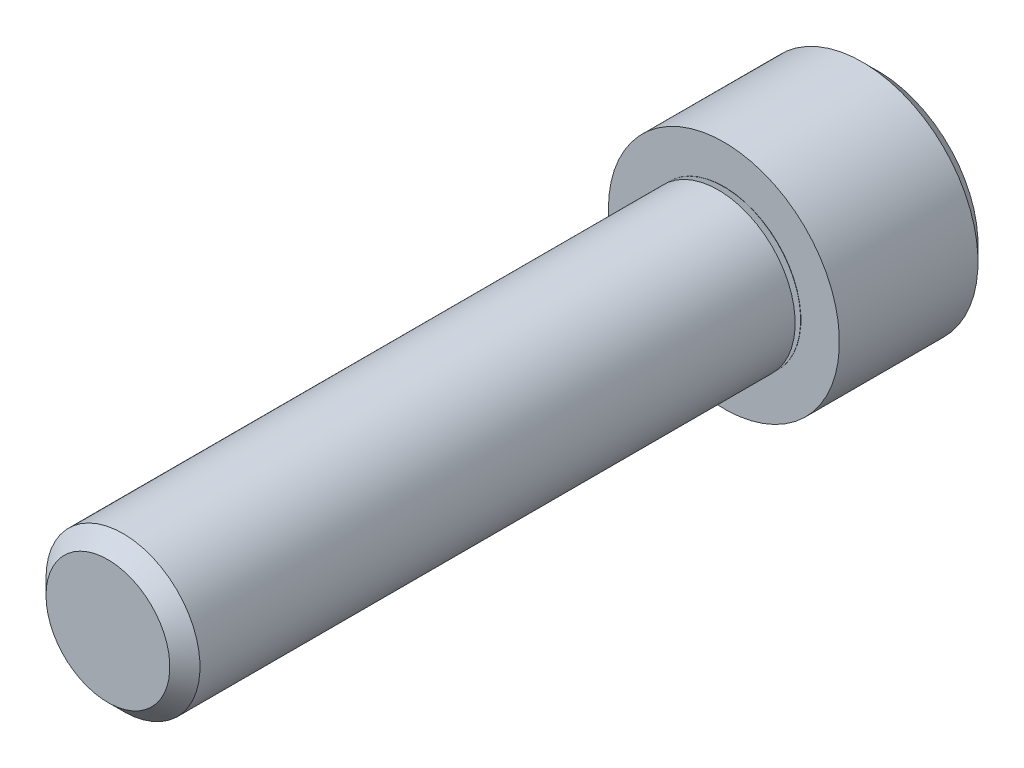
ISO-10303-21;
HEADER;
FILE_DESCRIPTION(('STEP AP214'),'2;1');
FILE_NAME('part.step','',(''),(''),'','','');
FILE_SCHEMA(('AUTOMOTIVE_DESIGN { 1 0 10303 214 1 1 1 1 }'));
ENDSEC;
DATA;
#1=APPLICATION_CONTEXT('core data for automotive mechanical design processes');
#2=APPLICATION_PROTOCOL_DEFINITION('international standard','automotive_design',2000,#1);
#3=PRODUCT_CONTEXT('',#1,'mechanical');
#4=PRODUCT('Part','Part','',(#3));
#5=PRODUCT_RELATED_PRODUCT_CATEGORY('part','',(#4));
#6=PRODUCT_DEFINITION_FORMATION('','',#4);
#7=PRODUCT_DEFINITION_CONTEXT('part definition',#1,'design');
#8=PRODUCT_DEFINITION('design','',#6,#7);
#9=PRODUCT_DEFINITION_SHAPE('','',#8);
#10=(LENGTH_UNIT() NAMED_UNIT(*) SI_UNIT(.MILLI.,.METRE.));
#11=(NAMED_UNIT(*) PLANE_ANGLE_UNIT() SI_UNIT($,.RADIAN.));
#12=(NAMED_UNIT(*) SI_UNIT($,.STERADIAN.) SOLID_ANGLE_UNIT());
#13=UNCERTAINTY_MEASURE_WITH_UNIT(LENGTH_MEASURE(1.E-05),#10,'distance_accuracy_value','');
#14=(GEOMETRIC_REPRESENTATION_CONTEXT(3) GLOBAL_UNCERTAINTY_ASSIGNED_CONTEXT((#13)) GLOBAL_UNIT_ASSIGNED_CONTEXT((#10,
#11,#12)) REPRESENTATION_CONTEXT('',''));
#15=CARTESIAN_POINT('',(0.,0.,0.));
#16=DIRECTION('',(0.,0.,1.));
#17=DIRECTION('',(1.,0.,0.));
#18=AXIS2_PLACEMENT_3D('',#15,#16,#17);
#19=CARTESIAN_POINT('',(0.,0.,-6.35));
#20=DIRECTION('',(0.,0.,1.));
#21=DIRECTION('',(1.,0.,0.));
#22=AXIS2_PLACEMENT_3D('',#19,#20,#21);
#23=PLANE('',#22);
#24=DIRECTION('',(-0.5,-0.866025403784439,0.));
#25=VECTOR('',#24,1.);
#26=CARTESIAN_POINT('',(2.74963065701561,0.,-6.35));
#27=LINE('',#26,#25);
#28=CARTESIAN_POINT('',(2.74963065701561,0.,-6.35));
#29=VERTEX_POINT('',#28);
#30=CARTESIAN_POINT('',(1.37481532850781,-2.38125,-6.35));
#31=VERTEX_POINT('',#30);
#32=EDGE_CURVE('E164',#29,#31,#27,.T.);
#33=ORIENTED_EDGE('',*,*,#32,.F.);
#34=DIRECTION('',(0.499999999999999,-0.866025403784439,0.));
#35=VECTOR('',#34,1.);
#36=CARTESIAN_POINT('',(1.37481532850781,2.38125,-6.35));
#37=LINE('',#36,#35);
#38=CARTESIAN_POINT('',(1.37481532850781,2.38125,-6.35));
#39=VERTEX_POINT('',#38);
#40=EDGE_CURVE('E73',#39,#29,#37,.T.);
#41=ORIENTED_EDGE('',*,*,#40,.F.);
#42=DIRECTION('',(1.,0.,0.));
#43=VECTOR('',#42,1.);
#44=CARTESIAN_POINT('',(-1.37481532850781,2.38125,-6.35));
#45=LINE('',#44,#43);
#46=CARTESIAN_POINT('',(-1.37481532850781,2.38125,-6.35));
#47=VERTEX_POINT('',#46);
#48=EDGE_CURVE('E177',#47,#39,#45,.T.);
#49=ORIENTED_EDGE('',*,*,#48,.F.);
#50=DIRECTION('',(0.5,0.866025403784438,0.));
#51=VECTOR('',#50,1.);
#52=CARTESIAN_POINT('',(-2.74963065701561,0.,-6.35));
#53=LINE('',#52,#51);
#54=CARTESIAN_POINT('',(-2.74963065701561,0.,-6.35));
#55=VERTEX_POINT('',#54);
#56=EDGE_CURVE('E174',#55,#47,#53,.T.);
#57=ORIENTED_EDGE('',*,*,#56,.F.);
#58=DIRECTION('',(-0.5,0.866025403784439,0.));
#59=VECTOR('',#58,1.);
#60=CARTESIAN_POINT('',(-1.37481532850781,-2.38125,-6.35));
#61=LINE('',#60,#59);
#62=CARTESIAN_POINT('',(-1.37481532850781,-2.38125,-6.35));
#63=VERTEX_POINT('',#62);
#64=EDGE_CURVE('E130',#63,#55,#61,.T.);
#65=ORIENTED_EDGE('',*,*,#64,.F.);
#66=DIRECTION('',(-1.,0.,0.));
#67=VECTOR('',#66,1.);
#68=CARTESIAN_POINT('',(1.37481532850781,-2.38125,-6.35));
#69=LINE('',#68,#67);
#70=EDGE_CURVE('E168',#31,#63,#69,.T.);
#71=ORIENTED_EDGE('',*,*,#70,.F.);
#72=EDGE_LOOP('',(#33,#41,#49,#57,#65,#71));
#73=FACE_BOUND('',#72,.T.);
#74=CARTESIAN_POINT('',(0.,0.,-6.35));
#75=DIRECTION('',(0.,0.,-1.));
#76=DIRECTION('',(-1.,0.,0.));
#77=AXIS2_PLACEMENT_3D('',#74,#75,#76);
#78=CIRCLE('',#77,4.1275);
#79=CARTESIAN_POINT('',(-4.1275,0.,-6.35));
#80=VERTEX_POINT('',#79);
#81=EDGE_CURVE('E183',#80,#80,#78,.T.);
#82=ORIENTED_EDGE('',*,*,#81,.T.);
#83=EDGE_LOOP('',(#82));
#84=FACE_BOUND('',#83,.T.);
#85=ADVANCED_FACE('F55',(#73,#84),#23,.F.);
#86=CARTESIAN_POINT('',(-2.55269999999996,0.,25.4));
#87=DIRECTION('',(0.,0.,-1.));
#88=DIRECTION('',(-1.,0.,0.));
#89=AXIS2_PLACEMENT_3D('',#86,#87,#88);
#90=PLANE('',#89);
#91=CARTESIAN_POINT('',(0.,0.,25.4));
#92=DIRECTION('',(0.,0.,-1.));
#93=DIRECTION('',(-1.,0.,0.));
#94=AXIS2_PLACEMENT_3D('',#91,#92,#93);
#95=CIRCLE('',#94,2.55270000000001);
#96=CARTESIAN_POINT('',(-2.55270000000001,0.,25.4));
#97=VERTEX_POINT('',#96);
#98=EDGE_CURVE('E11',#97,#97,#95,.T.);
#99=ORIENTED_EDGE('',*,*,#98,.F.);
#100=EDGE_LOOP('',(#99));
#101=FACE_BOUND('',#100,.T.);
#102=ADVANCED_FACE('F234',(#101),#90,.F.);
#103=CARTESIAN_POINT('',(0.,0.,25.4));
#104=DIRECTION('',(0.,0.,-1.));
#105=DIRECTION('',(-1.,0.,0.));
#106=AXIS2_PLACEMENT_3D('',#103,#104,#105);
#107=CONICAL_SURFACE('',#106,2.55270000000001,0.785398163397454);
#108=CARTESIAN_POINT('',(0.,0.,24.7777));
#109=DIRECTION('',(0.,0.,-1.));
#110=DIRECTION('',(-1.,0.,0.));
#111=AXIS2_PLACEMENT_3D('',#108,#109,#110);
#112=CIRCLE('',#111,3.17500000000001);
#113=CARTESIAN_POINT('',(-3.17500000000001,0.,24.7777));
#114=VERTEX_POINT('',#113);
#115=EDGE_CURVE('E63',#114,#114,#112,.T.);
#116=ORIENTED_EDGE('',*,*,#115,.F.);
#117=EDGE_LOOP('',(#116));
#118=FACE_BOUND('',#117,.T.);
#119=ORIENTED_EDGE('',*,*,#98,.T.);
#120=EDGE_LOOP('',(#119));
#121=FACE_BOUND('',#120,.T.);
#122=ADVANCED_FACE('F231',(#118,#121),#107,.T.);
#123=CARTESIAN_POINT('',(0.,0.,-10.585154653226));
#124=DIRECTION('',(0.,0.,-1.));
#125=DIRECTION('',(-1.,0.,0.));
#126=AXIS2_PLACEMENT_3D('',#123,#124,#125);
#127=CYLINDRICAL_SURFACE('',#126,3.17500000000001);
#128=CARTESIAN_POINT('',(0.,0.,0.236498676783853));
#129=DIRECTION('',(0.,0.,-1.));
#130=DIRECTION('',(-1.,0.,0.));
#131=AXIS2_PLACEMENT_3D('',#128,#129,#130);
#132=CIRCLE('',#131,3.17500000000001);
#133=CARTESIAN_POINT('',(-3.17500000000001,0.,0.236498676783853));
#134=VERTEX_POINT('',#133);
#135=EDGE_CURVE('E220',#134,#134,#132,.T.);
#136=ORIENTED_EDGE('',*,*,#135,.F.);
#137=EDGE_LOOP('',(#136));
#138=FACE_BOUND('',#137,.T.);
#139=ORIENTED_EDGE('',*,*,#115,.T.);
#140=EDGE_LOOP('',(#139));
#141=FACE_BOUND('',#140,.T.);
#142=ADVANCED_FACE('F229',(#138,#141),#127,.T.);
#143=CARTESIAN_POINT('',(0.,0.,0.236498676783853));
#144=DIRECTION('',(0.,0.,1.));
#145=DIRECTION('',(1.,0.,0.));
#146=AXIS2_PLACEMENT_3D('',#143,#144,#145);
#147=CONICAL_SURFACE('',#146,3.17500000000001,1.22173047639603);
#148=CARTESIAN_POINT('',(0.,0.,0.0487938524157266));
#149=DIRECTION('',(0.,0.,-1.));
#150=DIRECTION('',(-1.,0.,0.));
#151=AXIS2_PLACEMENT_3D('',#148,#149,#150);
#152=CIRCLE('',#151,2.65928523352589);
#153=CARTESIAN_POINT('',(-2.65928523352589,0.,0.0487938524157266));
#154=VERTEX_POINT('',#153);
#155=EDGE_CURVE('E216',#154,#154,#152,.T.);
#156=ORIENTED_EDGE('',*,*,#155,.F.);
#157=EDGE_LOOP('',(#156));
#158=FACE_BOUND('',#157,.T.);
#159=ORIENTED_EDGE('',*,*,#135,.T.);
#160=EDGE_LOOP('',(#159));
#161=FACE_BOUND('',#160,.T.);
#162=ADVANCED_FACE('F248',(#158,#161),#147,.T.);
#163=CARTESIAN_POINT('',(0.,0.,0.0300000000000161));
#164=DIRECTION('',(0.,0.,-1.));
#165=DIRECTION('',(-1.,0.,0.));
#166=AXIS2_PLACEMENT_3D('',#163,#164,#165);
#167=TOROIDAL_SURFACE('',#166,2.6661256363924,0.0199999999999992);
#168=CARTESIAN_POINT('',(0.,0.,0.0100000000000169));
#169=DIRECTION('',(0.,0.,-1.));
#170=DIRECTION('',(-1.,0.,0.));
#171=AXIS2_PLACEMENT_3D('',#168,#169,#170);
#172=CIRCLE('',#171,2.6661256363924);
#173=CARTESIAN_POINT('',(-2.6661256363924,0.,0.0100000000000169));
#174=VERTEX_POINT('',#173);
#175=EDGE_CURVE('E212',#174,#174,#172,.T.);
#176=ORIENTED_EDGE('',*,*,#175,.F.);
#177=EDGE_LOOP('',(#176));
#178=FACE_BOUND('',#177,.T.);
#179=ORIENTED_EDGE('',*,*,#155,.T.);
#180=EDGE_LOOP('',(#179));
#181=FACE_BOUND('',#180,.T.);
#182=ADVANCED_FACE('F252',(#178,#181),#167,.F.);
#183=CARTESIAN_POINT('',(-3.17500000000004,0.,0.0100000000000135));
#184=DIRECTION('',(0.,0.,-1.));
#185=DIRECTION('',(-1.,0.,0.));
#186=AXIS2_PLACEMENT_3D('',#183,#184,#185);
#187=PLANE('',#186);
#188=CARTESIAN_POINT('',(0.,0.,0.01000000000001));
#189=DIRECTION('',(0.,0.,-1.));
#190=DIRECTION('',(-1.,0.,0.));
#191=AXIS2_PLACEMENT_3D('',#188,#189,#190);
#192=CIRCLE('',#191,3.175);
#193=CARTESIAN_POINT('',(-3.175,0.,0.01000000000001));
#194=VERTEX_POINT('',#193);
#195=EDGE_CURVE('E208',#194,#194,#192,.T.);
#196=ORIENTED_EDGE('',*,*,#195,.F.);
#197=EDGE_LOOP('',(#196));
#198=FACE_BOUND('',#197,.T.);
#199=ORIENTED_EDGE('',*,*,#175,.T.);
#200=EDGE_LOOP('',(#199));
#201=FACE_BOUND('',#200,.T.);
#202=ADVANCED_FACE('F256',(#198,#201),#187,.F.);
#203=CARTESIAN_POINT('',(0.,0.,-10.585154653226));
#204=DIRECTION('',(0.,0.,-1.));
#205=DIRECTION('',(-1.,0.,0.));
#206=AXIS2_PLACEMENT_3D('',#203,#204,#205);
#207=CYLINDRICAL_SURFACE('',#206,3.175);
#208=CARTESIAN_POINT('',(0.,0.,0.));
#209=DIRECTION('',(0.,0.,-1.));
#210=DIRECTION('',(-1.,0.,0.));
#211=AXIS2_PLACEMENT_3D('',#208,#209,#210);
#212=CIRCLE('',#211,3.175);
#213=CARTESIAN_POINT('',(-3.175,0.,0.));
#214=VERTEX_POINT('',#213);
#215=EDGE_CURVE('E204',#214,#214,#212,.T.);
#216=ORIENTED_EDGE('',*,*,#215,.F.);
#217=EDGE_LOOP('',(#216));
#218=FACE_BOUND('',#217,.T.);
#219=ORIENTED_EDGE('',*,*,#195,.T.);
#220=EDGE_LOOP('',(#219));
#221=FACE_BOUND('',#220,.T.);
#222=ADVANCED_FACE('F260',(#218,#221),#207,.T.);
#223=CARTESIAN_POINT('',(-4.7625,0.,0.));
#224=DIRECTION('',(0.,0.,-1.));
#225=DIRECTION('',(-1.,0.,0.));
#226=AXIS2_PLACEMENT_3D('',#223,#224,#225);
#227=PLANE('',#226);
#228=CARTESIAN_POINT('',(0.,0.,0.));
#229=DIRECTION('',(0.,0.,-1.));
#230=DIRECTION('',(-1.,0.,0.));
#231=AXIS2_PLACEMENT_3D('',#228,#229,#230);
#232=CIRCLE('',#231,4.7625);
#233=CARTESIAN_POINT('',(-4.7625,0.,0.));
#234=VERTEX_POINT('',#233);
#235=EDGE_CURVE('E200',#234,#234,#232,.T.);
#236=ORIENTED_EDGE('',*,*,#235,.F.);
#237=EDGE_LOOP('',(#236));
#238=FACE_BOUND('',#237,.T.);
#239=ORIENTED_EDGE('',*,*,#215,.T.);
#240=EDGE_LOOP('',(#239));
#241=FACE_BOUND('',#240,.T.);
#242=ADVANCED_FACE('F264',(#238,#241),#227,.F.);
#243=CARTESIAN_POINT('',(0.,0.,-10.585154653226));
#244=DIRECTION('',(0.,0.,-1.));
#245=DIRECTION('',(-1.,0.,0.));
#246=AXIS2_PLACEMENT_3D('',#243,#244,#245);
#247=CYLINDRICAL_SURFACE('',#246,4.7625);
#248=CARTESIAN_POINT('',(0.,0.,-5.715));
#249=DIRECTION('',(0.,0.,-1.));
#250=DIRECTION('',(-1.,0.,0.));
#251=AXIS2_PLACEMENT_3D('',#248,#249,#250);
#252=CIRCLE('',#251,4.7625);
#253=CARTESIAN_POINT('',(-4.7625,0.,-5.715));
#254=VERTEX_POINT('',#253);
#255=EDGE_CURVE('E196',#254,#254,#252,.T.);
#256=ORIENTED_EDGE('',*,*,#255,.F.);
#257=EDGE_LOOP('',(#256));
#258=FACE_BOUND('',#257,.T.);
#259=ORIENTED_EDGE('',*,*,#235,.T.);
#260=EDGE_LOOP('',(#259));
#261=FACE_BOUND('',#260,.T.);
#262=ADVANCED_FACE('F268',(#258,#261),#247,.T.);
#263=CARTESIAN_POINT('',(0.,0.,-5.715));
#264=DIRECTION('',(0.,0.,1.));
#265=DIRECTION('',(1.,0.,0.));
#266=AXIS2_PLACEMENT_3D('',#263,#264,#265);
#267=CONICAL_SURFACE('',#266,4.7625,0.785398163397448);
#268=ORIENTED_EDGE('',*,*,#81,.F.);
#269=EDGE_LOOP('',(#268));
#270=FACE_BOUND('',#269,.T.);
#271=ORIENTED_EDGE('',*,*,#255,.T.);
#272=EDGE_LOOP('',(#271));
#273=FACE_BOUND('',#272,.T.);
#274=ADVANCED_FACE('F272',(#270,#273),#267,.T.);
#275=CARTESIAN_POINT('',(1.37481532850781,2.38125,-3.175));
#276=DIRECTION('',(0.866025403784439,0.499999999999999,0.));
#277=DIRECTION('',(-0.5,0.866025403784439,0.));
#278=AXIS2_PLACEMENT_3D('',#275,#276,#277);
#279=PLANE('',#278);
#280=ORIENTED_EDGE('',*,*,#40,.T.);
#281=DIRECTION('',(0.,0.,-1.));
#282=VECTOR('',#281,1.);
#283=CARTESIAN_POINT('',(2.74963065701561,0.,-3.175));
#284=LINE('',#283,#282);
#285=CARTESIAN_POINT('',(2.74963065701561,0.,-3.175));
#286=VERTEX_POINT('',#285);
#287=EDGE_CURVE('E111',#286,#29,#284,.T.);
#288=ORIENTED_EDGE('',*,*,#287,.F.);
#289=DIRECTION('',(0.499999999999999,-0.866025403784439,0.));
#290=VECTOR('',#289,1.);
#291=CARTESIAN_POINT('',(1.37481532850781,2.38125,-3.175));
#292=LINE('',#291,#290);
#293=CARTESIAN_POINT('',(1.37481532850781,2.38125,-3.175));
#294=VERTEX_POINT('',#293);
#295=EDGE_CURVE('E180',#294,#286,#292,.T.);
#296=ORIENTED_EDGE('',*,*,#295,.F.);
#297=DIRECTION('',(0.,0.,-1.));
#298=VECTOR('',#297,1.);
#299=CARTESIAN_POINT('',(1.37481532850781,2.38125,-3.175));
#300=LINE('',#299,#298);
#301=EDGE_CURVE('E83',#294,#39,#300,.T.);
#302=ORIENTED_EDGE('',*,*,#301,.T.);
#303=EDGE_LOOP('',(#280,#288,#296,#302));
#304=FACE_BOUND('',#303,.T.);
#305=ADVANCED_FACE('F276',(#304),#279,.F.);
#306=CARTESIAN_POINT('',(-1.37481532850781,2.38125,-3.175));
#307=DIRECTION('',(0.,1.,0.));
#308=DIRECTION('',(-1.,0.,0.));
#309=AXIS2_PLACEMENT_3D('',#306,#307,#308);
#310=PLANE('',#309);
#311=ORIENTED_EDGE('',*,*,#48,.T.);
#312=ORIENTED_EDGE('',*,*,#301,.F.);
#313=DIRECTION('',(1.,0.,0.));
#314=VECTOR('',#313,1.);
#315=CARTESIAN_POINT('',(-1.37481532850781,2.38125,-3.175));
#316=LINE('',#315,#314);
#317=CARTESIAN_POINT('',(-1.37481532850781,2.38125,-3.175));
#318=VERTEX_POINT('',#317);
#319=EDGE_CURVE('E144',#318,#294,#316,.T.);
#320=ORIENTED_EDGE('',*,*,#319,.F.);
#321=DIRECTION('',(0.,0.,-1.));
#322=VECTOR('',#321,1.);
#323=CARTESIAN_POINT('',(-1.37481532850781,2.38125,-3.175));
#324=LINE('',#323,#322);
#325=EDGE_CURVE('E135',#318,#47,#324,.T.);
#326=ORIENTED_EDGE('',*,*,#325,.T.);
#327=EDGE_LOOP('',(#311,#312,#320,#326));
#328=FACE_BOUND('',#327,.T.);
#329=ADVANCED_FACE('F280',(#328),#310,.F.);
#330=CARTESIAN_POINT('',(-2.74963065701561,0.,-3.175));
#331=DIRECTION('',(-0.866025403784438,0.5,0.));
#332=DIRECTION('',(-0.5,-0.866025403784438,0.));
#333=AXIS2_PLACEMENT_3D('',#330,#331,#332);
#334=PLANE('',#333);
#335=ORIENTED_EDGE('',*,*,#56,.T.);
#336=ORIENTED_EDGE('',*,*,#325,.F.);
#337=DIRECTION('',(0.5,0.866025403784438,0.));
#338=VECTOR('',#337,1.);
#339=CARTESIAN_POINT('',(-2.74963065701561,0.,-3.175));
#340=LINE('',#339,#338);
#341=CARTESIAN_POINT('',(-2.74963065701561,0.,-3.175));
#342=VERTEX_POINT('',#341);
#343=EDGE_CURVE('E139',#342,#318,#340,.T.);
#344=ORIENTED_EDGE('',*,*,#343,.F.);
#345=DIRECTION('',(0.,0.,-1.));
#346=VECTOR('',#345,1.);
#347=CARTESIAN_POINT('',(-2.74963065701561,0.,-3.175));
#348=LINE('',#347,#346);
#349=EDGE_CURVE('E123',#342,#55,#348,.T.);
#350=ORIENTED_EDGE('',*,*,#349,.T.);
#351=EDGE_LOOP('',(#335,#336,#344,#350));
#352=FACE_BOUND('',#351,.T.);
#353=ADVANCED_FACE('F140',(#352),#334,.F.);
#354=CARTESIAN_POINT('',(-1.37481532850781,-2.38125,-3.175));
#355=DIRECTION('',(-0.866025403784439,-0.5,0.));
#356=DIRECTION('',(0.5,-0.866025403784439,0.));
#357=AXIS2_PLACEMENT_3D('',#354,#355,#356);
#358=PLANE('',#357);
#359=ORIENTED_EDGE('',*,*,#64,.T.);
#360=ORIENTED_EDGE('',*,*,#349,.F.);
#361=DIRECTION('',(-0.5,0.866025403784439,0.));
#362=VECTOR('',#361,1.);
#363=CARTESIAN_POINT('',(-1.37481532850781,-2.38125,-3.175));
#364=LINE('',#363,#362);
#365=CARTESIAN_POINT('',(-1.37481532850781,-2.38125,-3.175));
#366=VERTEX_POINT('',#365);
#367=EDGE_CURVE('E127',#366,#342,#364,.T.);
#368=ORIENTED_EDGE('',*,*,#367,.F.);
#369=DIRECTION('',(0.,0.,-1.));
#370=VECTOR('',#369,1.);
#371=CARTESIAN_POINT('',(-1.37481532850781,-2.38125,-3.175));
#372=LINE('',#371,#370);
#373=EDGE_CURVE('E136',#366,#63,#372,.T.);
#374=ORIENTED_EDGE('',*,*,#373,.T.);
#375=EDGE_LOOP('',(#359,#360,#368,#374));
#376=FACE_BOUND('',#375,.T.);
#377=ADVANCED_FACE('F125',(#376),#358,.F.);
#378=CARTESIAN_POINT('',(1.37481532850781,-2.38125,-3.175));
#379=DIRECTION('',(0.,-1.,0.));
#380=DIRECTION('',(0.,0.,-1.));
#381=AXIS2_PLACEMENT_3D('',#378,#379,#380);
#382=PLANE('',#381);
#383=ORIENTED_EDGE('',*,*,#70,.T.);
#384=ORIENTED_EDGE('',*,*,#373,.F.);
#385=DIRECTION('',(-1.,0.,0.));
#386=VECTOR('',#385,1.);
#387=CARTESIAN_POINT('',(1.37481532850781,-2.38125,-3.175));
#388=LINE('',#387,#386);
#389=CARTESIAN_POINT('',(1.37481532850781,-2.38125,-3.175));
#390=VERTEX_POINT('',#389);
#391=EDGE_CURVE('E150',#390,#366,#388,.T.);
#392=ORIENTED_EDGE('',*,*,#391,.F.);
#393=DIRECTION('',(0.,0.,-1.));
#394=VECTOR('',#393,1.);
#395=CARTESIAN_POINT('',(1.37481532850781,-2.38125,-3.175));
#396=LINE('',#395,#394);
#397=EDGE_CURVE('E188',#390,#31,#396,.T.);
#398=ORIENTED_EDGE('',*,*,#397,.T.);
#399=EDGE_LOOP('',(#383,#384,#392,#398));
#400=FACE_BOUND('',#399,.T.);
#401=ADVANCED_FACE('F284',(#400),#382,.F.);
#402=CARTESIAN_POINT('',(2.74963065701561,0.,-3.175));
#403=DIRECTION('',(0.866025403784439,-0.5,0.));
#404=DIRECTION('',(0.5,0.866025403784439,0.));
#405=AXIS2_PLACEMENT_3D('',#402,#403,#404);
#406=PLANE('',#405);
#407=ORIENTED_EDGE('',*,*,#32,.T.);
#408=ORIENTED_EDGE('',*,*,#397,.F.);
#409=DIRECTION('',(-0.5,-0.866025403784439,0.));
#410=VECTOR('',#409,1.);
#411=CARTESIAN_POINT('',(2.74963065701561,0.,-3.175));
#412=LINE('',#411,#410);
#413=EDGE_CURVE('E156',#286,#390,#412,.T.);
#414=ORIENTED_EDGE('',*,*,#413,.F.);
#415=ORIENTED_EDGE('',*,*,#287,.T.);
#416=EDGE_LOOP('',(#407,#408,#414,#415));
#417=FACE_BOUND('',#416,.T.);
#418=ADVANCED_FACE('F281',(#417),#406,.F.);
#419=CARTESIAN_POINT('',(1.37481532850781,2.38125,-3.175));
#420=DIRECTION('',(0.,0.,1.));
#421=DIRECTION('',(1.,0.,0.));
#422=AXIS2_PLACEMENT_3D('',#419,#420,#421);
#423=PLANE('',#422);
#424=ORIENTED_EDGE('',*,*,#295,.T.);
#425=ORIENTED_EDGE('',*,*,#413,.T.);
#426=ORIENTED_EDGE('',*,*,#391,.T.);
#427=ORIENTED_EDGE('',*,*,#367,.T.);
#428=ORIENTED_EDGE('',*,*,#343,.T.);
#429=ORIENTED_EDGE('',*,*,#319,.T.);
#430=EDGE_LOOP('',(#424,#425,#426,#427,#428,#429));
#431=FACE_BOUND('',#430,.T.);
#432=ADVANCED_FACE('F147',(#431),#423,.F.);
#433=CLOSED_SHELL('',(#85,#102,#122,#142,#162,#182,#202,#222,#242,#262,#274,#305,#329,#353,#377,
#401,#418,#432));
#434=MANIFOLD_SOLID_BREP('B2',#433);
#435=ADVANCED_BREP_SHAPE_REPRESENTATION('',(#18,#434),#14);
#436=SHAPE_DEFINITION_REPRESENTATION(#9,#435);
ENDSEC;
END-ISO-10303-21;
